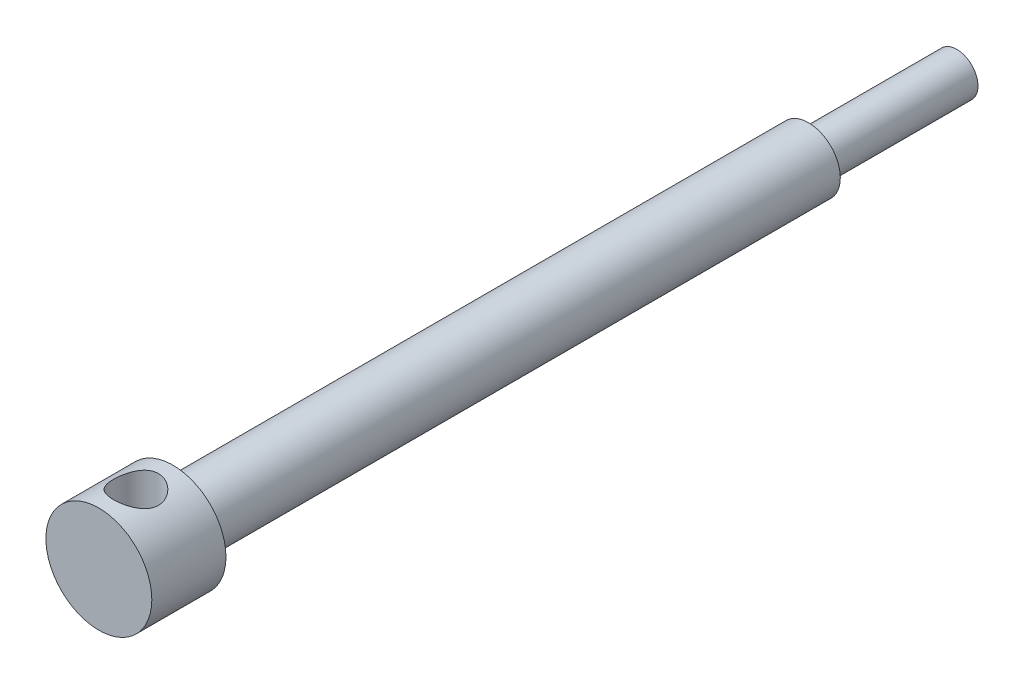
from build123d import *

# Parameters (mm, degrees)
F_97_0_0059_DIAMETER_HOLE1_D           = 6.7564
F_97_0_0059_DIAMETER_HOLE1_ON_FACE_2_D = 6.7564


with BuildPart() as part:
    # Sketch1 → Revolve1 (revolve)
    with BuildSketch(Plane(origin=(0, 0, 0), x_dir=(0, 0, -1), z_dir=(1, 0, 0)), mode=Mode.PRIVATE) as revolve1_sk:
        Polygon((-5.55625, 0), (-5.55625, 7.9375), (5.55625, 7.9375), (5.55625, 4.7625), (100.80625, 4.7625), (100.80625, 3.175), (123.03125, 3.175), (123.03125, 0), align=None)
    revolve(revolve1_sk.sketch.rotate(Axis((0, 0, 83.264258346), (0, 0, -1)), 90), axis=Axis((0, 0, 83.264258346), (0, 0, -1)))

    # 97 _0.0059_ Diameter Hole1 (through all)
    with Locations(Plane(origin=(0, -7.9375, 0), x_dir=(-1, 0, 0), z_dir=(0, -1, 0))):
        with Locations((0, 0)):
            Hole(F_97_0_0059_DIAMETER_HOLE1_D / 2)

    # 97 _0.0059_ Diameter Hole1 on face 2 (through all)
    with Locations(Plane(origin=(0, 0, 0), x_dir=(-1, 0, 0), z_dir=(0, -1, 0))):
        with Locations((0, 0)):
            Hole(F_97_0_0059_DIAMETER_HOLE1_ON_FACE_2_D / 2)


solid = part.part
